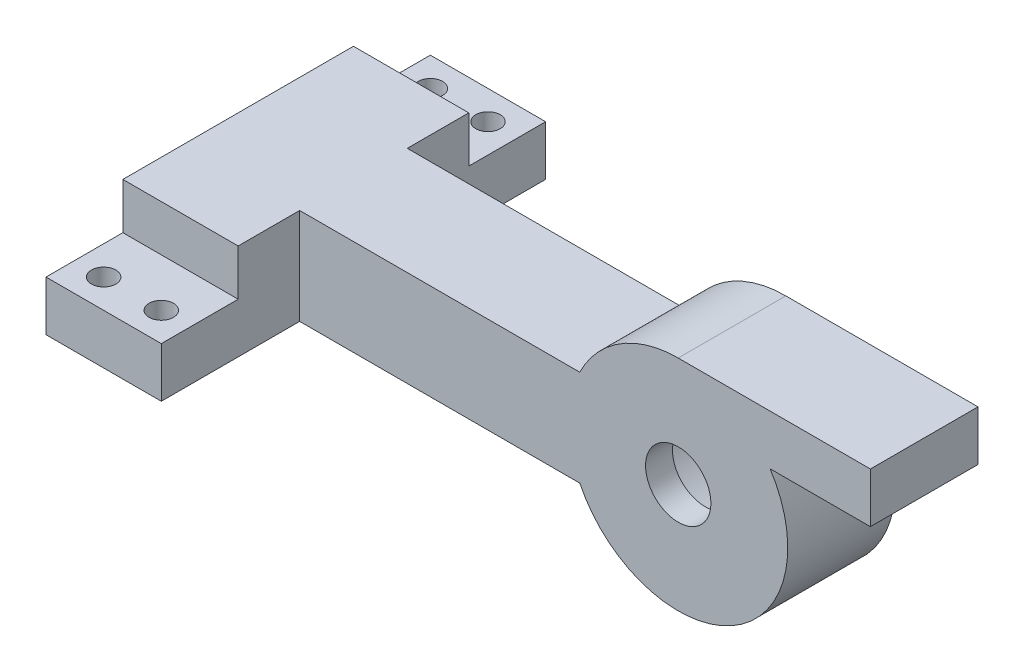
ISO-10303-21;
HEADER;
FILE_DESCRIPTION(('STEP AP214'),'2;1');
FILE_NAME('part.step','',(''),(''),'','','');
FILE_SCHEMA(('AUTOMOTIVE_DESIGN { 1 0 10303 214 1 1 1 1 }'));
ENDSEC;
DATA;
#1=APPLICATION_CONTEXT('core data for automotive mechanical design processes');
#2=APPLICATION_PROTOCOL_DEFINITION('international standard','automotive_design',2000,#1);
#3=PRODUCT_CONTEXT('',#1,'mechanical');
#4=PRODUCT('Part','Part','',(#3));
#5=PRODUCT_RELATED_PRODUCT_CATEGORY('part','',(#4));
#6=PRODUCT_DEFINITION_FORMATION('','',#4);
#7=PRODUCT_DEFINITION_CONTEXT('part definition',#1,'design');
#8=PRODUCT_DEFINITION('design','',#6,#7);
#9=PRODUCT_DEFINITION_SHAPE('','',#8);
#10=(LENGTH_UNIT() NAMED_UNIT(*) SI_UNIT(.MILLI.,.METRE.));
#11=(NAMED_UNIT(*) PLANE_ANGLE_UNIT() SI_UNIT($,.RADIAN.));
#12=(NAMED_UNIT(*) SI_UNIT($,.STERADIAN.) SOLID_ANGLE_UNIT());
#13=UNCERTAINTY_MEASURE_WITH_UNIT(LENGTH_MEASURE(1.E-05),#10,'distance_accuracy_value','');
#14=(GEOMETRIC_REPRESENTATION_CONTEXT(3) GLOBAL_UNCERTAINTY_ASSIGNED_CONTEXT((#13)) GLOBAL_UNIT_ASSIGNED_CONTEXT((#10,
#11,#12)) REPRESENTATION_CONTEXT('',''));
#15=CARTESIAN_POINT('',(0.,0.,0.));
#16=DIRECTION('',(0.,0.,1.));
#17=DIRECTION('',(1.,0.,0.));
#18=AXIS2_PLACEMENT_3D('',#15,#16,#17);
#19=CARTESIAN_POINT('',(128.5,12.5,14.));
#20=DIRECTION('',(0.,0.,-1.));
#21=DIRECTION('',(-1.,0.,0.));
#22=AXIS2_PLACEMENT_3D('',#19,#20,#21);
#23=CYLINDRICAL_SURFACE('',#22,28.5);
#24=CARTESIAN_POINT('',(128.5,12.5,-14.));
#25=DIRECTION('',(0.,0.,1.));
#26=DIRECTION('',(1.,0.,0.));
#27=AXIS2_PLACEMENT_3D('',#24,#25,#26);
#28=CIRCLE('',#27,28.5);
#29=CARTESIAN_POINT('',(102.887503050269,0.,-14.));
#30=VERTEX_POINT('',#29);
#31=CARTESIAN_POINT('',(152.416521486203,28.,-14.));
#32=VERTEX_POINT('',#31);
#33=EDGE_CURVE('E283',#30,#32,#28,.T.);
#34=ORIENTED_EDGE('',*,*,#33,.T.);
#35=DIRECTION('',(0.,0.,1.));
#36=VECTOR('',#35,1.);
#37=CARTESIAN_POINT('',(152.416521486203,28.,-65.662365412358));
#38=LINE('',#37,#36);
#39=CARTESIAN_POINT('',(152.416521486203,28.,14.));
#40=VERTEX_POINT('',#39);
#41=EDGE_CURVE('E64',#32,#40,#38,.T.);
#42=ORIENTED_EDGE('',*,*,#41,.T.);
#43=CARTESIAN_POINT('',(128.5,12.5,14.));
#44=DIRECTION('',(0.,0.,1.));
#45=DIRECTION('',(1.,0.,0.));
#46=AXIS2_PLACEMENT_3D('',#43,#44,#45);
#47=CIRCLE('',#46,28.5);
#48=CARTESIAN_POINT('',(102.887503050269,0.,14.));
#49=VERTEX_POINT('',#48);
#50=EDGE_CURVE('E276',#49,#40,#47,.T.);
#51=ORIENTED_EDGE('',*,*,#50,.F.);
#52=DIRECTION('',(0.,0.,-1.));
#53=VECTOR('',#52,1.);
#54=CARTESIAN_POINT('',(102.887503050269,0.,14.));
#55=LINE('',#54,#53);
#56=EDGE_CURVE('E292',#49,#30,#55,.T.);
#57=ORIENTED_EDGE('',*,*,#56,.T.);
#58=EDGE_LOOP('',(#34,#42,#51,#57));
#59=FACE_BOUND('',#58,.T.);
#60=ADVANCED_FACE('F41',(#59),#23,.T.);
#61=CARTESIAN_POINT('',(128.5,12.5,7.));
#62=DIRECTION('',(0.,0.,1.));
#63=DIRECTION('',(1.,0.,0.));
#64=AXIS2_PLACEMENT_3D('',#61,#62,#63);
#65=PLANE('',#64);
#66=CARTESIAN_POINT('',(128.5,12.5,7.));
#67=DIRECTION('',(0.,0.,1.));
#68=DIRECTION('',(1.,0.,0.));
#69=AXIS2_PLACEMENT_3D('',#66,#67,#68);
#70=CIRCLE('',#69,8.50000000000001);
#71=CARTESIAN_POINT('',(137.,12.5,7.));
#72=VERTEX_POINT('',#71);
#73=EDGE_CURVE('E49',#72,#72,#70,.T.);
#74=ORIENTED_EDGE('',*,*,#73,.T.);
#75=EDGE_LOOP('',(#74));
#76=FACE_BOUND('',#75,.T.);
#77=CARTESIAN_POINT('',(128.5,12.5,7.));
#78=DIRECTION('',(0.,0.,1.));
#79=DIRECTION('',(1.,0.,0.));
#80=AXIS2_PLACEMENT_3D('',#77,#78,#79);
#81=CIRCLE('',#80,23.5);
#82=CARTESIAN_POINT('',(152.,12.5,7.));
#83=VERTEX_POINT('',#82);
#84=EDGE_CURVE('E11',#83,#83,#81,.T.);
#85=ORIENTED_EDGE('',*,*,#84,.F.);
#86=EDGE_LOOP('',(#85));
#87=FACE_BOUND('',#86,.T.);
#88=ADVANCED_FACE('F315',(#76,#87),#65,.F.);
#89=CARTESIAN_POINT('',(128.5,12.5,14.));
#90=DIRECTION('',(0.,0.,1.));
#91=DIRECTION('',(1.,0.,0.));
#92=AXIS2_PLACEMENT_3D('',#89,#90,#91);
#93=PLANE('',#92);
#94=CARTESIAN_POINT('',(128.5,12.5,14.));
#95=DIRECTION('',(0.,0.,1.));
#96=DIRECTION('',(1.,0.,0.));
#97=AXIS2_PLACEMENT_3D('',#94,#95,#96);
#98=CIRCLE('',#97,8.50000000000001);
#99=CARTESIAN_POINT('',(137.,12.5,14.));
#100=VERTEX_POINT('',#99);
#101=EDGE_CURVE('E307',#100,#100,#98,.T.);
#102=ORIENTED_EDGE('',*,*,#101,.F.);
#103=EDGE_LOOP('',(#102));
#104=FACE_BOUND('',#103,.T.);
#105=DIRECTION('',(-1.,0.,0.));
#106=VECTOR('',#105,1.);
#107=CARTESIAN_POINT('',(100.,25.,14.));
#108=LINE('',#107,#106);
#109=CARTESIAN_POINT('',(102.887503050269,25.,14.));
#110=VERTEX_POINT('',#109);
#111=CARTESIAN_POINT('',(30.,24.9999999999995,14.));
#112=VERTEX_POINT('',#111);
#113=EDGE_CURVE('E278',#110,#112,#108,.T.);
#114=ORIENTED_EDGE('',*,*,#113,.T.);
#115=DIRECTION('',(0.,-1.,0.));
#116=VECTOR('',#115,1.);
#117=CARTESIAN_POINT('',(30.,12.5,14.));
#118=LINE('',#117,#116);
#119=CARTESIAN_POINT('',(30.,0.,14.));
#120=VERTEX_POINT('',#119);
#121=EDGE_CURVE('E267',#112,#120,#118,.T.);
#122=ORIENTED_EDGE('',*,*,#121,.T.);
#123=DIRECTION('',(1.,0.,0.));
#124=VECTOR('',#123,1.);
#125=CARTESIAN_POINT('',(0.,0.,14.));
#126=LINE('',#125,#124);
#127=EDGE_CURVE('E273',#120,#49,#126,.T.);
#128=ORIENTED_EDGE('',*,*,#127,.T.);
#129=ORIENTED_EDGE('',*,*,#50,.T.);
#130=DIRECTION('',(1.,0.,0.));
#131=VECTOR('',#130,1.);
#132=CARTESIAN_POINT('',(0.,28.,14.));
#133=LINE('',#132,#131);
#134=CARTESIAN_POINT('',(178.5,28.,14.));
#135=VERTEX_POINT('',#134);
#136=EDGE_CURVE('E168',#40,#135,#133,.T.);
#137=ORIENTED_EDGE('',*,*,#136,.T.);
#138=DIRECTION('',(0.,1.,0.));
#139=VECTOR('',#138,1.);
#140=CARTESIAN_POINT('',(178.5,0.,14.));
#141=LINE('',#140,#139);
#142=CARTESIAN_POINT('',(178.5,41.,14.));
#143=VERTEX_POINT('',#142);
#144=EDGE_CURVE('E162',#135,#143,#141,.T.);
#145=ORIENTED_EDGE('',*,*,#144,.T.);
#146=DIRECTION('',(-1.,0.,0.));
#147=VECTOR('',#146,1.);
#148=CARTESIAN_POINT('',(0.,41.,14.));
#149=LINE('',#148,#147);
#150=CARTESIAN_POINT('',(128.5,41.,14.));
#151=VERTEX_POINT('',#150);
#152=EDGE_CURVE('E171',#143,#151,#149,.T.);
#153=ORIENTED_EDGE('',*,*,#152,.T.);
#154=EDGE_CURVE('E56',#151,#110,#47,.T.);
#155=ORIENTED_EDGE('',*,*,#154,.T.);
#156=EDGE_LOOP('',(#114,#122,#128,#129,#137,#145,#153,#155));
#157=FACE_BOUND('',#156,.T.);
#158=ADVANCED_FACE('F43',(#104,#157),#93,.T.);
#159=CARTESIAN_POINT('',(128.5,12.5,7.));
#160=DIRECTION('',(0.,0.,1.));
#161=DIRECTION('',(1.,0.,0.));
#162=AXIS2_PLACEMENT_3D('',#159,#160,#161);
#163=CYLINDRICAL_SURFACE('',#162,8.50000000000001);
#164=ORIENTED_EDGE('',*,*,#73,.F.);
#165=EDGE_LOOP('',(#164));
#166=FACE_BOUND('',#165,.T.);
#167=ORIENTED_EDGE('',*,*,#101,.T.);
#168=EDGE_LOOP('',(#167));
#169=FACE_BOUND('',#168,.T.);
#170=ADVANCED_FACE('F312',(#166,#169),#163,.F.);
#171=CARTESIAN_POINT('',(128.5,12.5,14.));
#172=DIRECTION('',(0.,0.,-1.));
#173=DIRECTION('',(-1.,0.,0.));
#174=AXIS2_PLACEMENT_3D('',#171,#172,#173);
#175=CYLINDRICAL_SURFACE('',#174,23.5);
#176=CARTESIAN_POINT('',(128.5,12.5,-14.));
#177=DIRECTION('',(0.,0.,1.));
#178=DIRECTION('',(1.,0.,0.));
#179=AXIS2_PLACEMENT_3D('',#176,#177,#178);
#180=CIRCLE('',#179,23.5);
#181=CARTESIAN_POINT('',(152.,12.5,-14.));
#182=VERTEX_POINT('',#181);
#183=EDGE_CURVE('E269',#182,#182,#180,.T.);
#184=ORIENTED_EDGE('',*,*,#183,.F.);
#185=EDGE_LOOP('',(#184));
#186=FACE_BOUND('',#185,.T.);
#187=ORIENTED_EDGE('',*,*,#84,.T.);
#188=EDGE_LOOP('',(#187));
#189=FACE_BOUND('',#188,.T.);
#190=ADVANCED_FACE('F321',(#186,#189),#175,.F.);
#191=CARTESIAN_POINT('',(128.5,12.5,-14.));
#192=DIRECTION('',(0.,0.,1.));
#193=DIRECTION('',(1.,0.,0.));
#194=AXIS2_PLACEMENT_3D('',#191,#192,#193);
#195=PLANE('',#194);
#196=ORIENTED_EDGE('',*,*,#183,.T.);
#197=EDGE_LOOP('',(#196));
#198=FACE_BOUND('',#197,.T.);
#199=DIRECTION('',(0.,-1.,0.));
#200=VECTOR('',#199,1.);
#201=CARTESIAN_POINT('',(30.,12.5,-14.));
#202=LINE('',#201,#200);
#203=CARTESIAN_POINT('',(30.,25.,-14.));
#204=VERTEX_POINT('',#203);
#205=CARTESIAN_POINT('',(30.,0.,-14.));
#206=VERTEX_POINT('',#205);
#207=EDGE_CURVE('E265',#204,#206,#202,.T.);
#208=ORIENTED_EDGE('',*,*,#207,.F.);
#209=DIRECTION('',(-1.,0.,0.));
#210=VECTOR('',#209,1.);
#211=CARTESIAN_POINT('',(0.,25.,-14.));
#212=LINE('',#211,#210);
#213=CARTESIAN_POINT('',(102.887503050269,25.,-14.));
#214=VERTEX_POINT('',#213);
#215=EDGE_CURVE('E275',#214,#204,#212,.T.);
#216=ORIENTED_EDGE('',*,*,#215,.F.);
#217=CARTESIAN_POINT('',(128.5,41.,-14.));
#218=VERTEX_POINT('',#217);
#219=EDGE_CURVE('E282',#218,#214,#28,.T.);
#220=ORIENTED_EDGE('',*,*,#219,.F.);
#221=DIRECTION('',(1.,0.,0.));
#222=VECTOR('',#221,1.);
#223=CARTESIAN_POINT('',(0.,41.,-14.));
#224=LINE('',#223,#222);
#225=CARTESIAN_POINT('',(178.5,41.,-14.));
#226=VERTEX_POINT('',#225);
#227=EDGE_CURVE('E187',#218,#226,#224,.T.);
#228=ORIENTED_EDGE('',*,*,#227,.T.);
#229=DIRECTION('',(0.,-1.,0.));
#230=VECTOR('',#229,1.);
#231=CARTESIAN_POINT('',(178.5,0.,-14.));
#232=LINE('',#231,#230);
#233=CARTESIAN_POINT('',(178.5,28.,-14.));
#234=VERTEX_POINT('',#233);
#235=EDGE_CURVE('E164',#226,#234,#232,.T.);
#236=ORIENTED_EDGE('',*,*,#235,.T.);
#237=DIRECTION('',(-1.,0.,0.));
#238=VECTOR('',#237,1.);
#239=CARTESIAN_POINT('',(0.,28.,-14.));
#240=LINE('',#239,#238);
#241=EDGE_CURVE('E184',#234,#32,#240,.T.);
#242=ORIENTED_EDGE('',*,*,#241,.T.);
#243=ORIENTED_EDGE('',*,*,#33,.F.);
#244=DIRECTION('',(1.,0.,0.));
#245=VECTOR('',#244,1.);
#246=CARTESIAN_POINT('',(100.,0.,-14.));
#247=LINE('',#246,#245);
#248=EDGE_CURVE('E272',#206,#30,#247,.T.);
#249=ORIENTED_EDGE('',*,*,#248,.F.);
#250=EDGE_LOOP('',(#208,#216,#220,#228,#236,#242,#243,#249));
#251=FACE_BOUND('',#250,.T.);
#252=ADVANCED_FACE('F346',(#198,#251),#195,.F.);
#253=CARTESIAN_POINT('',(0.,0.,14.));
#254=DIRECTION('',(1.,0.,0.));
#255=DIRECTION('',(0.,0.,-1.));
#256=AXIS2_PLACEMENT_3D('',#253,#254,#255);
#257=PLANE('',#256);
#258=DIRECTION('',(0.,0.,-1.));
#259=VECTOR('',#258,1.);
#260=CARTESIAN_POINT('',(0.,25.,14.));
#261=LINE('',#260,#259);
#262=CARTESIAN_POINT('',(0.,25.,30.));
#263=VERTEX_POINT('',#262);
#264=CARTESIAN_POINT('',(0.,25.,-30.));
#265=VERTEX_POINT('',#264);
#266=EDGE_CURVE('E280',#263,#265,#261,.T.);
#267=ORIENTED_EDGE('',*,*,#266,.T.);
#268=DIRECTION('',(0.,-1.,0.));
#269=VECTOR('',#268,1.);
#270=CARTESIAN_POINT('',(0.,13.,-30.));
#271=LINE('',#270,#269);
#272=CARTESIAN_POINT('',(0.,13.,-30.));
#273=VERTEX_POINT('',#272);
#274=EDGE_CURVE('E214',#265,#273,#271,.T.);
#275=ORIENTED_EDGE('',*,*,#274,.T.);
#276=DIRECTION('',(0.,0.,-1.));
#277=VECTOR('',#276,1.);
#278=CARTESIAN_POINT('',(0.,13.,-30.));
#279=LINE('',#278,#277);
#280=CARTESIAN_POINT('',(0.,13.,-50.));
#281=VERTEX_POINT('',#280);
#282=EDGE_CURVE('E217',#273,#281,#279,.T.);
#283=ORIENTED_EDGE('',*,*,#282,.T.);
#284=DIRECTION('',(0.,-1.,0.));
#285=VECTOR('',#284,1.);
#286=CARTESIAN_POINT('',(0.,0.,-50.));
#287=LINE('',#286,#285);
#288=CARTESIAN_POINT('',(0.,0.,-50.));
#289=VERTEX_POINT('',#288);
#290=EDGE_CURVE('E243',#281,#289,#287,.T.);
#291=ORIENTED_EDGE('',*,*,#290,.T.);
#292=DIRECTION('',(0.,0.,-1.));
#293=VECTOR('',#292,1.);
#294=CARTESIAN_POINT('',(0.,0.,14.));
#295=LINE('',#294,#293);
#296=CARTESIAN_POINT('',(0.,0.,50.));
#297=VERTEX_POINT('',#296);
#298=EDGE_CURVE('E295',#297,#289,#295,.T.);
#299=ORIENTED_EDGE('',*,*,#298,.F.);
#300=DIRECTION('',(0.,-1.,0.));
#301=VECTOR('',#300,1.);
#302=CARTESIAN_POINT('',(0.,0.,50.));
#303=LINE('',#302,#301);
#304=CARTESIAN_POINT('',(0.,13.,50.));
#305=VERTEX_POINT('',#304);
#306=EDGE_CURVE('E244',#305,#297,#303,.T.);
#307=ORIENTED_EDGE('',*,*,#306,.F.);
#308=DIRECTION('',(0.,0.,-1.));
#309=VECTOR('',#308,1.);
#310=CARTESIAN_POINT('',(0.,13.,50.));
#311=LINE('',#310,#309);
#312=CARTESIAN_POINT('',(0.,13.,30.));
#313=VERTEX_POINT('',#312);
#314=EDGE_CURVE('E218',#305,#313,#311,.T.);
#315=ORIENTED_EDGE('',*,*,#314,.T.);
#316=DIRECTION('',(0.,1.,0.));
#317=VECTOR('',#316,1.);
#318=CARTESIAN_POINT('',(0.,25.,30.));
#319=LINE('',#318,#317);
#320=EDGE_CURVE('E231',#313,#263,#319,.T.);
#321=ORIENTED_EDGE('',*,*,#320,.T.);
#322=EDGE_LOOP('',(#267,#275,#283,#291,#299,#307,#315,#321));
#323=FACE_BOUND('',#322,.T.);
#324=ADVANCED_FACE('F341',(#323),#257,.F.);
#325=CARTESIAN_POINT('',(100.,0.,14.));
#326=DIRECTION('',(0.,1.,0.));
#327=DIRECTION('',(-1.,0.,0.));
#328=AXIS2_PLACEMENT_3D('',#325,#326,#327);
#329=PLANE('',#328);
#330=CARTESIAN_POINT('',(7.50000000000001,6.86950496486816E-13,42.5));
#331=DIRECTION('',(0.,1.,0.));
#332=DIRECTION('',(-1.,0.,0.));
#333=AXIS2_PLACEMENT_3D('',#330,#331,#332);
#334=CIRCLE('',#333,3.175);
#335=CARTESIAN_POINT('',(4.32500000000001,7.09839810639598E-13,42.5));
#336=VERTEX_POINT('',#335);
#337=EDGE_CURVE('E210',#336,#336,#334,.T.);
#338=ORIENTED_EDGE('',*,*,#337,.T.);
#339=EDGE_LOOP('',(#338));
#340=FACE_BOUND('',#339,.T.);
#341=CARTESIAN_POINT('',(22.5,5.79397640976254E-13,42.5));
#342=DIRECTION('',(0.,1.,0.));
#343=DIRECTION('',(-1.,0.,0.));
#344=AXIS2_PLACEMENT_3D('',#341,#342,#343);
#345=CIRCLE('',#344,3.175);
#346=CARTESIAN_POINT('',(19.325,6.02286955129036E-13,42.5));
#347=VERTEX_POINT('',#346);
#348=EDGE_CURVE('E207',#347,#347,#345,.T.);
#349=ORIENTED_EDGE('',*,*,#348,.T.);
#350=EDGE_LOOP('',(#349));
#351=FACE_BOUND('',#350,.T.);
#352=CARTESIAN_POINT('',(22.5,5.79397640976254E-13,-42.5));
#353=DIRECTION('',(0.,1.,0.));
#354=DIRECTION('',(-1.,0.,0.));
#355=AXIS2_PLACEMENT_3D('',#352,#353,#354);
#356=CIRCLE('',#355,3.175);
#357=CARTESIAN_POINT('',(19.325,6.02286955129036E-13,-42.5));
#358=VERTEX_POINT('',#357);
#359=EDGE_CURVE('E204',#358,#358,#356,.T.);
#360=ORIENTED_EDGE('',*,*,#359,.T.);
#361=EDGE_LOOP('',(#360));
#362=FACE_BOUND('',#361,.T.);
#363=CARTESIAN_POINT('',(7.50000000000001,6.86950496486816E-13,-42.5));
#364=DIRECTION('',(0.,1.,0.));
#365=DIRECTION('',(-1.,0.,0.));
#366=AXIS2_PLACEMENT_3D('',#363,#364,#365);
#367=CIRCLE('',#366,3.175);
#368=CARTESIAN_POINT('',(4.325,7.09839810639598E-13,-42.5));
#369=VERTEX_POINT('',#368);
#370=EDGE_CURVE('E201',#369,#369,#367,.T.);
#371=ORIENTED_EDGE('',*,*,#370,.T.);
#372=EDGE_LOOP('',(#371));
#373=FACE_BOUND('',#372,.T.);
#374=ORIENTED_EDGE('',*,*,#298,.T.);
#375=DIRECTION('',(1.,0.,0.));
#376=VECTOR('',#375,1.);
#377=CARTESIAN_POINT('',(0.,0.,-50.));
#378=LINE('',#377,#376);
#379=CARTESIAN_POINT('',(30.,0.,-50.));
#380=VERTEX_POINT('',#379);
#381=EDGE_CURVE('E254',#289,#380,#378,.T.);
#382=ORIENTED_EDGE('',*,*,#381,.T.);
#383=DIRECTION('',(0.,0.,-1.));
#384=VECTOR('',#383,1.);
#385=CARTESIAN_POINT('',(30.,0.,50.));
#386=LINE('',#385,#384);
#387=EDGE_CURVE('E261',#206,#380,#386,.T.);
#388=ORIENTED_EDGE('',*,*,#387,.F.);
#389=ORIENTED_EDGE('',*,*,#248,.T.);
#390=ORIENTED_EDGE('',*,*,#56,.F.);
#391=ORIENTED_EDGE('',*,*,#127,.F.);
#392=CARTESIAN_POINT('',(30.,0.,50.));
#393=VERTEX_POINT('',#392);
#394=EDGE_CURVE('E262',#393,#120,#386,.T.);
#395=ORIENTED_EDGE('',*,*,#394,.F.);
#396=DIRECTION('',(1.,0.,0.));
#397=VECTOR('',#396,1.);
#398=CARTESIAN_POINT('',(0.,0.,50.));
#399=LINE('',#398,#397);
#400=EDGE_CURVE('E246',#297,#393,#399,.T.);
#401=ORIENTED_EDGE('',*,*,#400,.F.);
#402=EDGE_LOOP('',(#374,#382,#388,#389,#390,#391,#395,#401));
#403=FACE_BOUND('',#402,.T.);
#404=ADVANCED_FACE('F334',(#340,#351,#362,#373,#403),#329,.F.);
#405=ORIENTED_EDGE('',*,*,#154,.F.);
#406=DIRECTION('',(0.,0.,1.));
#407=VECTOR('',#406,1.);
#408=CARTESIAN_POINT('',(128.5,41.,-65.662365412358));
#409=LINE('',#408,#407);
#410=EDGE_CURVE('E167',#218,#151,#409,.T.);
#411=ORIENTED_EDGE('',*,*,#410,.F.);
#412=ORIENTED_EDGE('',*,*,#219,.T.);
#413=DIRECTION('',(0.,0.,-1.));
#414=VECTOR('',#413,1.);
#415=CARTESIAN_POINT('',(102.887503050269,25.,14.));
#416=LINE('',#415,#414);
#417=EDGE_CURVE('E289',#110,#214,#416,.T.);
#418=ORIENTED_EDGE('',*,*,#417,.F.);
#419=EDGE_LOOP('',(#405,#411,#412,#418));
#420=FACE_BOUND('',#419,.T.);
#421=ADVANCED_FACE('F327',(#420),#23,.T.);
#422=CARTESIAN_POINT('',(0.,25.,14.));
#423=DIRECTION('',(0.,-1.,0.));
#424=DIRECTION('',(1.,0.,0.));
#425=AXIS2_PLACEMENT_3D('',#422,#423,#424);
#426=PLANE('',#425);
#427=DIRECTION('',(0.,0.,-1.));
#428=VECTOR('',#427,1.);
#429=CARTESIAN_POINT('',(30.,25.,50.));
#430=LINE('',#429,#428);
#431=CARTESIAN_POINT('',(30.,25.,-30.));
#432=VERTEX_POINT('',#431);
#433=EDGE_CURVE('E252',#204,#432,#430,.T.);
#434=ORIENTED_EDGE('',*,*,#433,.T.);
#435=DIRECTION('',(1.,0.,0.));
#436=VECTOR('',#435,1.);
#437=CARTESIAN_POINT('',(0.,25.,-30.));
#438=LINE('',#437,#436);
#439=EDGE_CURVE('E222',#265,#432,#438,.T.);
#440=ORIENTED_EDGE('',*,*,#439,.F.);
#441=ORIENTED_EDGE('',*,*,#266,.F.);
#442=DIRECTION('',(1.,0.,0.));
#443=VECTOR('',#442,1.);
#444=CARTESIAN_POINT('',(0.,25.,30.));
#445=LINE('',#444,#443);
#446=CARTESIAN_POINT('',(30.,25.,30.));
#447=VERTEX_POINT('',#446);
#448=EDGE_CURVE('E213',#263,#447,#445,.T.);
#449=ORIENTED_EDGE('',*,*,#448,.T.);
#450=EDGE_CURVE('E259',#447,#112,#430,.T.);
#451=ORIENTED_EDGE('',*,*,#450,.T.);
#452=ORIENTED_EDGE('',*,*,#113,.F.);
#453=ORIENTED_EDGE('',*,*,#417,.T.);
#454=ORIENTED_EDGE('',*,*,#215,.T.);
#455=EDGE_LOOP('',(#434,#440,#441,#449,#451,#452,#453,#454));
#456=FACE_BOUND('',#455,.T.);
#457=ADVANCED_FACE('F333',(#456),#426,.F.);
#458=CARTESIAN_POINT('',(0.,0.,-50.));
#459=DIRECTION('',(0.,0.,-1.));
#460=DIRECTION('',(-1.,0.,0.));
#461=AXIS2_PLACEMENT_3D('',#458,#459,#460);
#462=PLANE('',#461);
#463=DIRECTION('',(1.,0.,0.));
#464=VECTOR('',#463,1.);
#465=CARTESIAN_POINT('',(0.,13.,-50.));
#466=LINE('',#465,#464);
#467=CARTESIAN_POINT('',(30.,13.,-50.));
#468=VERTEX_POINT('',#467);
#469=EDGE_CURVE('E225',#281,#468,#466,.T.);
#470=ORIENTED_EDGE('',*,*,#469,.T.);
#471=DIRECTION('',(0.,1.,0.));
#472=VECTOR('',#471,1.);
#473=CARTESIAN_POINT('',(30.,0.,-50.));
#474=LINE('',#473,#472);
#475=EDGE_CURVE('E247',#380,#468,#474,.T.);
#476=ORIENTED_EDGE('',*,*,#475,.F.);
#477=ORIENTED_EDGE('',*,*,#381,.F.);
#478=ORIENTED_EDGE('',*,*,#290,.F.);
#479=EDGE_LOOP('',(#470,#476,#477,#478));
#480=FACE_BOUND('',#479,.T.);
#481=ADVANCED_FACE('F339',(#480),#462,.T.);
#482=CARTESIAN_POINT('',(30.,0.,50.));
#483=DIRECTION('',(-1.,0.,0.));
#484=DIRECTION('',(0.,0.,1.));
#485=AXIS2_PLACEMENT_3D('',#482,#483,#484);
#486=PLANE('',#485);
#487=DIRECTION('',(0.,0.,1.));
#488=VECTOR('',#487,1.);
#489=CARTESIAN_POINT('',(30.,13.,50.));
#490=LINE('',#489,#488);
#491=CARTESIAN_POINT('',(30.,13.,-30.));
#492=VERTEX_POINT('',#491);
#493=EDGE_CURVE('E301',#468,#492,#490,.T.);
#494=ORIENTED_EDGE('',*,*,#493,.T.);
#495=DIRECTION('',(0.,1.,0.));
#496=VECTOR('',#495,1.);
#497=CARTESIAN_POINT('',(30.,0.,-30.));
#498=LINE('',#497,#496);
#499=EDGE_CURVE('E304',#492,#432,#498,.T.);
#500=ORIENTED_EDGE('',*,*,#499,.T.);
#501=ORIENTED_EDGE('',*,*,#433,.F.);
#502=ORIENTED_EDGE('',*,*,#207,.T.);
#503=ORIENTED_EDGE('',*,*,#387,.T.);
#504=ORIENTED_EDGE('',*,*,#475,.T.);
#505=EDGE_LOOP('',(#494,#500,#501,#502,#503,#504));
#506=FACE_BOUND('',#505,.T.);
#507=ADVANCED_FACE('F367',(#506),#486,.F.);
#508=ORIENTED_EDGE('',*,*,#450,.F.);
#509=DIRECTION('',(0.,-1.,0.));
#510=VECTOR('',#509,1.);
#511=CARTESIAN_POINT('',(30.,0.,30.));
#512=LINE('',#511,#510);
#513=CARTESIAN_POINT('',(30.,13.,30.));
#514=VERTEX_POINT('',#513);
#515=EDGE_CURVE('E298',#447,#514,#512,.T.);
#516=ORIENTED_EDGE('',*,*,#515,.T.);
#517=DIRECTION('',(0.,0.,1.));
#518=VECTOR('',#517,1.);
#519=CARTESIAN_POINT('',(30.,13.,50.));
#520=LINE('',#519,#518);
#521=CARTESIAN_POINT('',(30.,13.,50.));
#522=VERTEX_POINT('',#521);
#523=EDGE_CURVE('E224',#514,#522,#520,.T.);
#524=ORIENTED_EDGE('',*,*,#523,.T.);
#525=DIRECTION('',(0.,1.,0.));
#526=VECTOR('',#525,1.);
#527=CARTESIAN_POINT('',(30.,0.,50.));
#528=LINE('',#527,#526);
#529=EDGE_CURVE('E249',#393,#522,#528,.T.);
#530=ORIENTED_EDGE('',*,*,#529,.F.);
#531=ORIENTED_EDGE('',*,*,#394,.T.);
#532=ORIENTED_EDGE('',*,*,#121,.F.);
#533=EDGE_LOOP('',(#508,#516,#524,#530,#531,#532));
#534=FACE_BOUND('',#533,.T.);
#535=ADVANCED_FACE('F381',(#534),#486,.F.);
#536=CARTESIAN_POINT('',(0.,0.,50.));
#537=DIRECTION('',(0.,0.,-1.));
#538=DIRECTION('',(-1.,0.,0.));
#539=AXIS2_PLACEMENT_3D('',#536,#537,#538);
#540=PLANE('',#539);
#541=ORIENTED_EDGE('',*,*,#529,.T.);
#542=DIRECTION('',(1.,0.,0.));
#543=VECTOR('',#542,1.);
#544=CARTESIAN_POINT('',(0.,13.,50.));
#545=LINE('',#544,#543);
#546=EDGE_CURVE('E229',#305,#522,#545,.T.);
#547=ORIENTED_EDGE('',*,*,#546,.F.);
#548=ORIENTED_EDGE('',*,*,#306,.T.);
#549=ORIENTED_EDGE('',*,*,#400,.T.);
#550=EDGE_LOOP('',(#541,#547,#548,#549));
#551=FACE_BOUND('',#550,.T.);
#552=ADVANCED_FACE('F384',(#551),#540,.F.);
#553=CARTESIAN_POINT('',(0.,25.,30.));
#554=DIRECTION('',(0.,0.,-1.));
#555=DIRECTION('',(0.,1.,0.));
#556=AXIS2_PLACEMENT_3D('',#553,#554,#555);
#557=PLANE('',#556);
#558=ORIENTED_EDGE('',*,*,#448,.F.);
#559=ORIENTED_EDGE('',*,*,#320,.F.);
#560=DIRECTION('',(1.,0.,0.));
#561=VECTOR('',#560,1.);
#562=CARTESIAN_POINT('',(0.,13.,30.));
#563=LINE('',#562,#561);
#564=EDGE_CURVE('E232',#313,#514,#563,.T.);
#565=ORIENTED_EDGE('',*,*,#564,.T.);
#566=ORIENTED_EDGE('',*,*,#515,.F.);
#567=EDGE_LOOP('',(#558,#559,#565,#566));
#568=FACE_BOUND('',#567,.T.);
#569=ADVANCED_FACE('F390',(#568),#557,.F.);
#570=CARTESIAN_POINT('',(0.,13.,50.));
#571=DIRECTION('',(0.,-1.,0.));
#572=DIRECTION('',(0.,0.,-1.));
#573=AXIS2_PLACEMENT_3D('',#570,#571,#572);
#574=PLANE('',#573);
#575=CARTESIAN_POINT('',(7.50000000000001,13.,42.5));
#576=DIRECTION('',(0.,1.,0.));
#577=DIRECTION('',(0.,0.,1.));
#578=AXIS2_PLACEMENT_3D('',#575,#576,#577);
#579=CIRCLE('',#578,3.175);
#580=CARTESIAN_POINT('',(7.50000000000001,13.,45.675));
#581=VERTEX_POINT('',#580);
#582=EDGE_CURVE('E189',#581,#581,#579,.T.);
#583=ORIENTED_EDGE('',*,*,#582,.F.);
#584=EDGE_LOOP('',(#583));
#585=FACE_BOUND('',#584,.T.);
#586=CARTESIAN_POINT('',(22.5,13.,42.5));
#587=DIRECTION('',(0.,1.,0.));
#588=DIRECTION('',(0.,0.,1.));
#589=AXIS2_PLACEMENT_3D('',#586,#587,#588);
#590=CIRCLE('',#589,3.175);
#591=CARTESIAN_POINT('',(22.5,13.,45.675));
#592=VERTEX_POINT('',#591);
#593=EDGE_CURVE('E194',#592,#592,#590,.T.);
#594=ORIENTED_EDGE('',*,*,#593,.F.);
#595=EDGE_LOOP('',(#594));
#596=FACE_BOUND('',#595,.T.);
#597=ORIENTED_EDGE('',*,*,#564,.F.);
#598=ORIENTED_EDGE('',*,*,#314,.F.);
#599=ORIENTED_EDGE('',*,*,#546,.T.);
#600=ORIENTED_EDGE('',*,*,#523,.F.);
#601=EDGE_LOOP('',(#597,#598,#599,#600));
#602=FACE_BOUND('',#601,.T.);
#603=ADVANCED_FACE('F388',(#585,#596,#602),#574,.F.);
#604=CARTESIAN_POINT('',(0.,13.,-30.));
#605=DIRECTION('',(0.,0.,1.));
#606=DIRECTION('',(1.,0.,0.));
#607=AXIS2_PLACEMENT_3D('',#604,#605,#606);
#608=PLANE('',#607);
#609=DIRECTION('',(1.,0.,0.));
#610=VECTOR('',#609,1.);
#611=CARTESIAN_POINT('',(0.,13.,-30.));
#612=LINE('',#611,#610);
#613=EDGE_CURVE('E221',#273,#492,#612,.T.);
#614=ORIENTED_EDGE('',*,*,#613,.F.);
#615=ORIENTED_EDGE('',*,*,#274,.F.);
#616=ORIENTED_EDGE('',*,*,#439,.T.);
#617=ORIENTED_EDGE('',*,*,#499,.F.);
#618=EDGE_LOOP('',(#614,#615,#616,#617));
#619=FACE_BOUND('',#618,.T.);
#620=ADVANCED_FACE('F396',(#619),#608,.F.);
#621=CARTESIAN_POINT('',(0.,13.,-30.));
#622=DIRECTION('',(0.,-1.,0.));
#623=DIRECTION('',(0.,0.,-1.));
#624=AXIS2_PLACEMENT_3D('',#621,#622,#623);
#625=PLANE('',#624);
#626=CARTESIAN_POINT('',(22.5,13.,-42.5));
#627=DIRECTION('',(0.,1.,0.));
#628=DIRECTION('',(0.,0.,1.));
#629=AXIS2_PLACEMENT_3D('',#626,#627,#628);
#630=CIRCLE('',#629,3.175);
#631=CARTESIAN_POINT('',(22.5,13.,-39.325));
#632=VERTEX_POINT('',#631);
#633=EDGE_CURVE('E190',#632,#632,#630,.T.);
#634=ORIENTED_EDGE('',*,*,#633,.F.);
#635=EDGE_LOOP('',(#634));
#636=FACE_BOUND('',#635,.T.);
#637=CARTESIAN_POINT('',(7.50000000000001,13.,-42.5));
#638=DIRECTION('',(0.,1.,0.));
#639=DIRECTION('',(0.,0.,1.));
#640=AXIS2_PLACEMENT_3D('',#637,#638,#639);
#641=CIRCLE('',#640,3.175);
#642=CARTESIAN_POINT('',(7.50000000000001,13.,-39.325));
#643=VERTEX_POINT('',#642);
#644=EDGE_CURVE('E193',#643,#643,#641,.T.);
#645=ORIENTED_EDGE('',*,*,#644,.F.);
#646=EDGE_LOOP('',(#645));
#647=FACE_BOUND('',#646,.T.);
#648=ORIENTED_EDGE('',*,*,#469,.F.);
#649=ORIENTED_EDGE('',*,*,#282,.F.);
#650=ORIENTED_EDGE('',*,*,#613,.T.);
#651=ORIENTED_EDGE('',*,*,#493,.F.);
#652=EDGE_LOOP('',(#648,#649,#650,#651));
#653=FACE_BOUND('',#652,.T.);
#654=ADVANCED_FACE('F399',(#636,#647,#653),#625,.F.);
#655=CARTESIAN_POINT('',(7.50000000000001,-16.,-42.5));
#656=DIRECTION('',(0.,1.,0.));
#657=DIRECTION('',(0.,0.,1.));
#658=AXIS2_PLACEMENT_3D('',#655,#656,#657);
#659=CYLINDRICAL_SURFACE('',#658,3.175);
#660=ORIENTED_EDGE('',*,*,#644,.T.);
#661=EDGE_LOOP('',(#660));
#662=FACE_BOUND('',#661,.T.);
#663=ORIENTED_EDGE('',*,*,#370,.F.);
#664=EDGE_LOOP('',(#663));
#665=FACE_BOUND('',#664,.T.);
#666=ADVANCED_FACE('F401',(#662,#665),#659,.F.);
#667=CARTESIAN_POINT('',(22.5,-16.,-42.5));
#668=DIRECTION('',(0.,1.,0.));
#669=DIRECTION('',(0.,0.,1.));
#670=AXIS2_PLACEMENT_3D('',#667,#668,#669);
#671=CYLINDRICAL_SURFACE('',#670,3.175);
#672=ORIENTED_EDGE('',*,*,#633,.T.);
#673=EDGE_LOOP('',(#672));
#674=FACE_BOUND('',#673,.T.);
#675=ORIENTED_EDGE('',*,*,#359,.F.);
#676=EDGE_LOOP('',(#675));
#677=FACE_BOUND('',#676,.T.);
#678=ADVANCED_FACE('F408',(#674,#677),#671,.F.);
#679=CARTESIAN_POINT('',(22.5,-16.,42.5));
#680=DIRECTION('',(0.,1.,0.));
#681=DIRECTION('',(0.,0.,1.));
#682=AXIS2_PLACEMENT_3D('',#679,#680,#681);
#683=CYLINDRICAL_SURFACE('',#682,3.175);
#684=ORIENTED_EDGE('',*,*,#593,.T.);
#685=EDGE_LOOP('',(#684));
#686=FACE_BOUND('',#685,.T.);
#687=ORIENTED_EDGE('',*,*,#348,.F.);
#688=EDGE_LOOP('',(#687));
#689=FACE_BOUND('',#688,.T.);
#690=ADVANCED_FACE('F529',(#686,#689),#683,.F.);
#691=CARTESIAN_POINT('',(7.50000000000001,-16.,42.5));
#692=DIRECTION('',(0.,1.,0.));
#693=DIRECTION('',(0.,0.,1.));
#694=AXIS2_PLACEMENT_3D('',#691,#692,#693);
#695=CYLINDRICAL_SURFACE('',#694,3.175);
#696=ORIENTED_EDGE('',*,*,#582,.T.);
#697=EDGE_LOOP('',(#696));
#698=FACE_BOUND('',#697,.T.);
#699=ORIENTED_EDGE('',*,*,#337,.F.);
#700=EDGE_LOOP('',(#699));
#701=FACE_BOUND('',#700,.T.);
#702=ADVANCED_FACE('F539',(#698,#701),#695,.F.);
#703=CARTESIAN_POINT('',(178.5,0.,-65.662365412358));
#704=DIRECTION('',(1.,0.,0.));
#705=DIRECTION('',(0.,0.,-1.));
#706=AXIS2_PLACEMENT_3D('',#703,#704,#705);
#707=PLANE('',#706);
#708=ORIENTED_EDGE('',*,*,#235,.F.);
#709=DIRECTION('',(0.,0.,1.));
#710=VECTOR('',#709,1.);
#711=CARTESIAN_POINT('',(178.5,41.,-65.662365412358));
#712=LINE('',#711,#710);
#713=EDGE_CURVE('E157',#226,#143,#712,.T.);
#714=ORIENTED_EDGE('',*,*,#713,.T.);
#715=ORIENTED_EDGE('',*,*,#144,.F.);
#716=DIRECTION('',(0.,0.,1.));
#717=VECTOR('',#716,1.);
#718=CARTESIAN_POINT('',(178.5,28.,-65.662365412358));
#719=LINE('',#718,#717);
#720=EDGE_CURVE('E182',#234,#135,#719,.T.);
#721=ORIENTED_EDGE('',*,*,#720,.F.);
#722=EDGE_LOOP('',(#708,#714,#715,#721));
#723=FACE_BOUND('',#722,.T.);
#724=ADVANCED_FACE('F159',(#723),#707,.T.);
#725=CARTESIAN_POINT('',(0.,28.,-65.662365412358));
#726=DIRECTION('',(0.,-1.,0.));
#727=DIRECTION('',(0.,0.,-1.));
#728=AXIS2_PLACEMENT_3D('',#725,#726,#727);
#729=PLANE('',#728);
#730=ORIENTED_EDGE('',*,*,#241,.F.);
#731=ORIENTED_EDGE('',*,*,#720,.T.);
#732=ORIENTED_EDGE('',*,*,#136,.F.);
#733=ORIENTED_EDGE('',*,*,#41,.F.);
#734=EDGE_LOOP('',(#730,#731,#732,#733));
#735=FACE_BOUND('',#734,.T.);
#736=ADVANCED_FACE('F561',(#735),#729,.T.);
#737=CARTESIAN_POINT('',(0.,41.,-65.662365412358));
#738=DIRECTION('',(0.,1.,0.));
#739=DIRECTION('',(-1.,0.,0.));
#740=AXIS2_PLACEMENT_3D('',#737,#738,#739);
#741=PLANE('',#740);
#742=ORIENTED_EDGE('',*,*,#227,.F.);
#743=ORIENTED_EDGE('',*,*,#410,.T.);
#744=ORIENTED_EDGE('',*,*,#152,.F.);
#745=ORIENTED_EDGE('',*,*,#713,.F.);
#746=EDGE_LOOP('',(#742,#743,#744,#745));
#747=FACE_BOUND('',#746,.T.);
#748=ADVANCED_FACE('F172',(#747),#741,.T.);
#749=CLOSED_SHELL('',(#60,#88,#158,#170,#190,#252,#324,#404,#421,#457,#481,#507,#535,#552,#569,
#603,#620,#654,#666,#678,#690,#702,#724,#736,#748));
#750=MANIFOLD_SOLID_BREP('B2',#749);
#751=ADVANCED_BREP_SHAPE_REPRESENTATION('',(#18,#750),#14);
#752=SHAPE_DEFINITION_REPRESENTATION(#9,#751);
ENDSEC;
END-ISO-10303-21;
